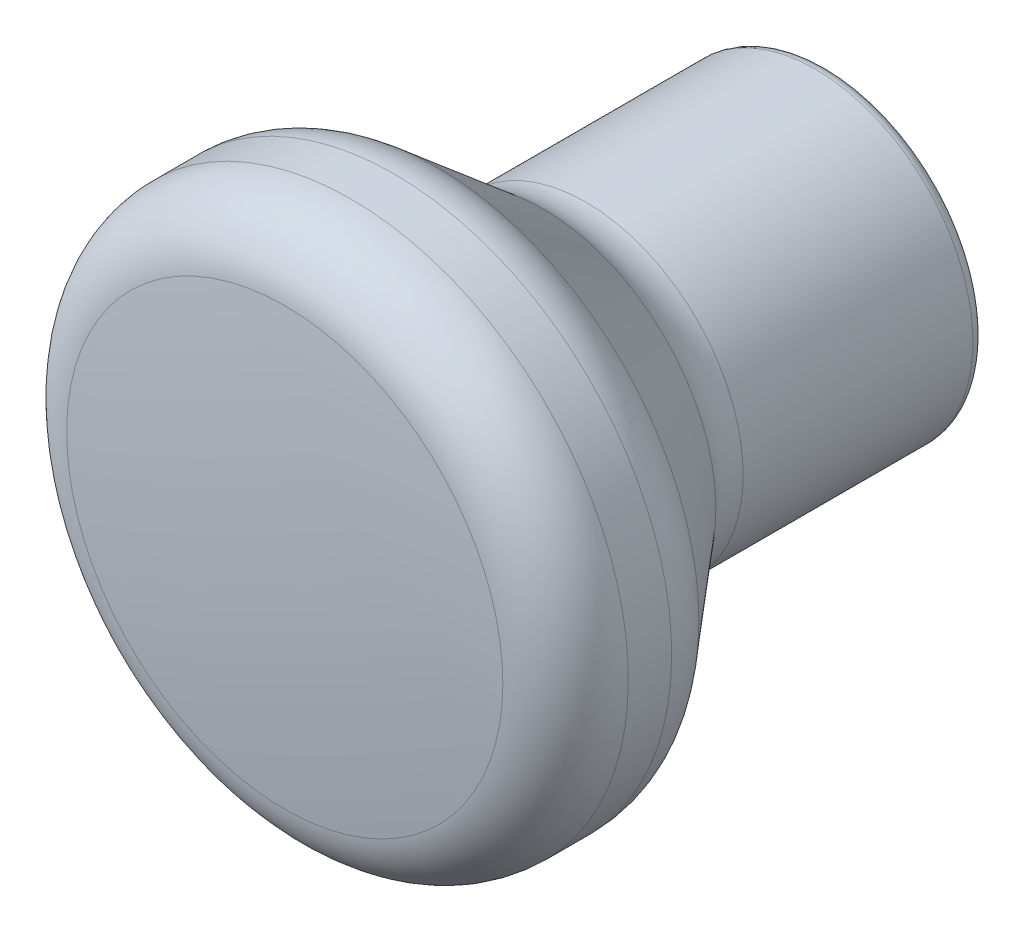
ISO-10303-21;
HEADER;
FILE_DESCRIPTION(('STEP AP214'),'2;1');
FILE_NAME('part.step','',(''),(''),'','','');
FILE_SCHEMA(('AUTOMOTIVE_DESIGN { 1 0 10303 214 1 1 1 1 }'));
ENDSEC;
DATA;
#1=APPLICATION_CONTEXT('core data for automotive mechanical design processes');
#2=APPLICATION_PROTOCOL_DEFINITION('international standard','automotive_design',2000,#1);
#3=PRODUCT_CONTEXT('',#1,'mechanical');
#4=PRODUCT('Part','Part','',(#3));
#5=PRODUCT_RELATED_PRODUCT_CATEGORY('part','',(#4));
#6=PRODUCT_DEFINITION_FORMATION('','',#4);
#7=PRODUCT_DEFINITION_CONTEXT('part definition',#1,'design');
#8=PRODUCT_DEFINITION('design','',#6,#7);
#9=PRODUCT_DEFINITION_SHAPE('','',#8);
#10=(LENGTH_UNIT() NAMED_UNIT(*) SI_UNIT(.MILLI.,.METRE.));
#11=(NAMED_UNIT(*) PLANE_ANGLE_UNIT() SI_UNIT($,.RADIAN.));
#12=(NAMED_UNIT(*) SI_UNIT($,.STERADIAN.) SOLID_ANGLE_UNIT());
#13=UNCERTAINTY_MEASURE_WITH_UNIT(LENGTH_MEASURE(1.E-05),#10,'distance_accuracy_value','');
#14=(GEOMETRIC_REPRESENTATION_CONTEXT(3) GLOBAL_UNCERTAINTY_ASSIGNED_CONTEXT((#13)) GLOBAL_UNIT_ASSIGNED_CONTEXT((#10,
#11,#12)) REPRESENTATION_CONTEXT('',''));
#15=CARTESIAN_POINT('',(0.,0.,0.));
#16=DIRECTION('',(0.,0.,1.));
#17=DIRECTION('',(1.,0.,0.));
#18=AXIS2_PLACEMENT_3D('',#15,#16,#17);
#19=CARTESIAN_POINT('',(0.,0.,-64.9999999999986));
#20=DIRECTION('',(0.,0.,-1.));
#21=DIRECTION('',(1.,0.,0.));
#22=AXIS2_PLACEMENT_3D('',#19,#20,#21);
#23=SPHERICAL_SURFACE('',#22,89.9999999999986);
#24=CARTESIAN_POINT('',(0.,0.,24.461827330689));
#25=DIRECTION('',(0.,0.,-1.));
#26=DIRECTION('',(0.,1.,0.));
#27=AXIS2_PLACEMENT_3D('',#24,#25,#26);
#28=CIRCLE('',#27,9.82758620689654);
#29=CARTESIAN_POINT('',(0.,9.82758620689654,24.461827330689));
#30=VERTEX_POINT('',#29);
#31=EDGE_CURVE('E8',#30,#30,#28,.T.);
#32=ORIENTED_EDGE('',*,*,#31,.F.);
#33=EDGE_LOOP('',(#32));
#34=FACE_BOUND('',#33,.T.);
#35=ADVANCED_FACE('F12',(#34),#23,.T.);
#36=CARTESIAN_POINT('',(0.,0.,21.479766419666));
#37=DIRECTION('',(0.,0.,-1.));
#38=DIRECTION('',(0.,1.,0.));
#39=AXIS2_PLACEMENT_3D('',#36,#37,#38);
#40=TOROIDAL_SURFACE('',#39,9.5,3.);
#41=ORIENTED_EDGE('',*,*,#31,.T.);
#42=EDGE_LOOP('',(#41));
#43=FACE_BOUND('',#42,.T.);
#44=CARTESIAN_POINT('',(0.,0.,21.479766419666));
#45=DIRECTION('',(0.,0.,-1.));
#46=DIRECTION('',(0.,1.,0.));
#47=AXIS2_PLACEMENT_3D('',#44,#45,#46);
#48=CIRCLE('',#47,12.5);
#49=CARTESIAN_POINT('',(0.,12.5,21.479766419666));
#50=VERTEX_POINT('',#49);
#51=EDGE_CURVE('E18',#50,#50,#48,.T.);
#52=ORIENTED_EDGE('',*,*,#51,.F.);
#53=EDGE_LOOP('',(#52));
#54=FACE_BOUND('',#53,.T.);
#55=ADVANCED_FACE('F77',(#43,#54),#40,.T.);
#56=CARTESIAN_POINT('',(0.,0.,0.));
#57=DIRECTION('',(0.,0.,-1.));
#58=DIRECTION('',(0.,1.,0.));
#59=AXIS2_PLACEMENT_3D('',#56,#57,#58);
#60=CYLINDRICAL_SURFACE('',#59,12.5);
#61=CARTESIAN_POINT('',(0.,0.,19.5273801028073));
#62=DIRECTION('',(0.,0.,-1.));
#63=DIRECTION('',(0.,1.,0.));
#64=AXIS2_PLACEMENT_3D('',#61,#62,#63);
#65=CIRCLE('',#64,12.5);
#66=CARTESIAN_POINT('',(0.,12.5,19.5273801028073));
#67=VERTEX_POINT('',#66);
#68=EDGE_CURVE('E22',#67,#67,#65,.T.);
#69=ORIENTED_EDGE('',*,*,#68,.F.);
#70=EDGE_LOOP('',(#69));
#71=FACE_BOUND('',#70,.T.);
#72=ORIENTED_EDGE('',*,*,#51,.T.);
#73=EDGE_LOOP('',(#72));
#74=FACE_BOUND('',#73,.T.);
#75=ADVANCED_FACE('F82',(#71,#74),#60,.T.);
#76=CARTESIAN_POINT('',(0.,0.,19.5273801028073));
#77=DIRECTION('',(0.,0.,-1.));
#78=DIRECTION('',(0.,1.,0.));
#79=AXIS2_PLACEMENT_3D('',#76,#77,#78);
#80=TOROIDAL_SURFACE('',#79,9.5,3.);
#81=ORIENTED_EDGE('',*,*,#68,.T.);
#82=EDGE_LOOP('',(#81));
#83=FACE_BOUND('',#82,.T.);
#84=CARTESIAN_POINT('',(0.,0.,17.5990172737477));
#85=DIRECTION('',(0.,0.,-1.));
#86=DIRECTION('',(0.,1.,0.));
#87=AXIS2_PLACEMENT_3D('',#84,#85,#86);
#88=CIRCLE('',#87,11.7981333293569);
#89=CARTESIAN_POINT('',(0.,11.7981333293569,17.5990172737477));
#90=VERTEX_POINT('',#89);
#91=EDGE_CURVE('E26',#90,#90,#88,.T.);
#92=ORIENTED_EDGE('',*,*,#91,.F.);
#93=EDGE_LOOP('',(#92));
#94=FACE_BOUND('',#93,.T.);
#95=ADVANCED_FACE('F86',(#83,#94),#80,.T.);
#96=CARTESIAN_POINT('',(0.,0.,17.5990172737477));
#97=DIRECTION('',(0.,0.,1.));
#98=DIRECTION('',(0.,-1.,0.));
#99=AXIS2_PLACEMENT_3D('',#96,#97,#98);
#100=CONICAL_SURFACE('',#99,11.7981333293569,0.698131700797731);
#101=CARTESIAN_POINT('',(0.,0.,12.836452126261));
#102=DIRECTION('',(0.,0.,-1.));
#103=DIRECTION('',(0.,1.,0.));
#104=AXIS2_PLACEMENT_3D('',#101,#102,#103);
#105=CIRCLE('',#104,7.80186667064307);
#106=CARTESIAN_POINT('',(0.,7.80186667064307,12.836452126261));
#107=VERTEX_POINT('',#106);
#108=EDGE_CURVE('E31',#107,#107,#105,.T.);
#109=ORIENTED_EDGE('',*,*,#108,.F.);
#110=EDGE_LOOP('',(#109));
#111=FACE_BOUND('',#110,.T.);
#112=ORIENTED_EDGE('',*,*,#91,.T.);
#113=EDGE_LOOP('',(#112));
#114=FACE_BOUND('',#113,.T.);
#115=ADVANCED_FACE('F93',(#111,#114),#100,.T.);
#116=CARTESIAN_POINT('',(0.,0.,10.9080892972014));
#117=DIRECTION('',(0.,0.,-1.));
#118=DIRECTION('',(0.,1.,0.));
#119=AXIS2_PLACEMENT_3D('',#116,#117,#118);
#120=TOROIDAL_SURFACE('',#119,10.1,3.);
#121=CARTESIAN_POINT('',(0.,0.,10.9080892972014));
#122=DIRECTION('',(0.,0.,-1.));
#123=DIRECTION('',(0.,1.,0.));
#124=AXIS2_PLACEMENT_3D('',#121,#122,#123);
#125=CIRCLE('',#124,7.1);
#126=CARTESIAN_POINT('',(0.,7.1,10.9080892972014));
#127=VERTEX_POINT('',#126);
#128=EDGE_CURVE('E34',#127,#127,#125,.T.);
#129=ORIENTED_EDGE('',*,*,#128,.F.);
#130=EDGE_LOOP('',(#129));
#131=FACE_BOUND('',#130,.T.);
#132=ORIENTED_EDGE('',*,*,#108,.T.);
#133=EDGE_LOOP('',(#132));
#134=FACE_BOUND('',#133,.T.);
#135=ADVANCED_FACE('F73',(#131,#134),#120,.F.);
#136=CARTESIAN_POINT('',(0.,0.,0.));
#137=DIRECTION('',(0.,0.,-1.));
#138=DIRECTION('',(0.,1.,0.));
#139=AXIS2_PLACEMENT_3D('',#136,#137,#138);
#140=CYLINDRICAL_SURFACE('',#139,7.1);
#141=CARTESIAN_POINT('',(0.,0.,0.55));
#142=DIRECTION('',(0.,0.,-1.));
#143=DIRECTION('',(0.,1.,0.));
#144=AXIS2_PLACEMENT_3D('',#141,#142,#143);
#145=CIRCLE('',#144,7.1);
#146=CARTESIAN_POINT('',(0.,7.1,0.55));
#147=VERTEX_POINT('',#146);
#148=EDGE_CURVE('E37',#147,#147,#145,.T.);
#149=ORIENTED_EDGE('',*,*,#148,.F.);
#150=EDGE_LOOP('',(#149));
#151=FACE_BOUND('',#150,.T.);
#152=ORIENTED_EDGE('',*,*,#128,.T.);
#153=EDGE_LOOP('',(#152));
#154=FACE_BOUND('',#153,.T.);
#155=ADVANCED_FACE('F66',(#151,#154),#140,.T.);
#156=CARTESIAN_POINT('',(0.,0.,0.55));
#157=DIRECTION('',(0.,0.,-1.));
#158=DIRECTION('',(0.,1.,0.));
#159=AXIS2_PLACEMENT_3D('',#156,#157,#158);
#160=TOROIDAL_SURFACE('',#159,6.55,0.55);
#161=ORIENTED_EDGE('',*,*,#148,.T.);
#162=EDGE_LOOP('',(#161));
#163=FACE_BOUND('',#162,.T.);
#164=CARTESIAN_POINT('',(0.,0.,0.));
#165=DIRECTION('',(0.,0.,-1.));
#166=DIRECTION('',(0.,1.,0.));
#167=AXIS2_PLACEMENT_3D('',#164,#165,#166);
#168=CIRCLE('',#167,6.55);
#169=CARTESIAN_POINT('',(0.,6.55,0.));
#170=VERTEX_POINT('',#169);
#171=EDGE_CURVE('E40',#170,#170,#168,.T.);
#172=ORIENTED_EDGE('',*,*,#171,.F.);
#173=EDGE_LOOP('',(#172));
#174=FACE_BOUND('',#173,.T.);
#175=ADVANCED_FACE('F61',(#163,#174),#160,.T.);
#176=CARTESIAN_POINT('',(6.55,0.,0.));
#177=DIRECTION('',(0.,0.,1.));
#178=DIRECTION('',(0.,-1.,0.));
#179=AXIS2_PLACEMENT_3D('',#176,#177,#178);
#180=PLANE('',#179);
#181=CARTESIAN_POINT('',(0.,0.,0.));
#182=DIRECTION('',(0.,0.,-1.));
#183=DIRECTION('',(0.,1.,0.));
#184=AXIS2_PLACEMENT_3D('',#181,#182,#183);
#185=CIRCLE('',#184,3.);
#186=CARTESIAN_POINT('',(0.,3.,0.));
#187=VERTEX_POINT('',#186);
#188=EDGE_CURVE('E44',#187,#187,#185,.T.);
#189=ORIENTED_EDGE('',*,*,#188,.F.);
#190=EDGE_LOOP('',(#189));
#191=FACE_BOUND('',#190,.T.);
#192=ORIENTED_EDGE('',*,*,#171,.T.);
#193=EDGE_LOOP('',(#192));
#194=FACE_BOUND('',#193,.T.);
#195=ADVANCED_FACE('F55',(#191,#194),#180,.F.);
#196=CARTESIAN_POINT('',(0.,0.,12.));
#197=DIRECTION('',(0.,0.,-1.));
#198=DIRECTION('',(0.,1.,0.));
#199=AXIS2_PLACEMENT_3D('',#196,#197,#198);
#200=CYLINDRICAL_SURFACE('',#199,3.);
#201=CARTESIAN_POINT('',(0.,0.,12.));
#202=DIRECTION('',(0.,0.,-1.));
#203=DIRECTION('',(0.,1.,0.));
#204=AXIS2_PLACEMENT_3D('',#201,#202,#203);
#205=CIRCLE('',#204,3.);
#206=CARTESIAN_POINT('',(0.,3.,12.));
#207=VERTEX_POINT('',#206);
#208=EDGE_CURVE('E43',#207,#207,#205,.T.);
#209=ORIENTED_EDGE('',*,*,#208,.F.);
#210=EDGE_LOOP('',(#209));
#211=FACE_BOUND('',#210,.T.);
#212=ORIENTED_EDGE('',*,*,#188,.T.);
#213=EDGE_LOOP('',(#212));
#214=FACE_BOUND('',#213,.T.);
#215=ADVANCED_FACE('F52',(#211,#214),#200,.F.);
#216=CARTESIAN_POINT('',(0.,0.,12.));
#217=DIRECTION('',(0.,0.,-1.));
#218=DIRECTION('',(0.,1.,0.));
#219=AXIS2_PLACEMENT_3D('',#216,#217,#218);
#220=PLANE('',#219);
#221=ORIENTED_EDGE('',*,*,#208,.T.);
#222=EDGE_LOOP('',(#221));
#223=FACE_BOUND('',#222,.T.);
#224=ADVANCED_FACE('F50',(#223),#220,.T.);
#225=CLOSED_SHELL('',(#35,#55,#75,#95,#115,#135,#155,#175,#195,#215,#224));
#226=MANIFOLD_SOLID_BREP('B1',#225);
#227=ADVANCED_BREP_SHAPE_REPRESENTATION('',(#18,#226),#14);
#228=SHAPE_DEFINITION_REPRESENTATION(#9,#227);
ENDSEC;
END-ISO-10303-21;
